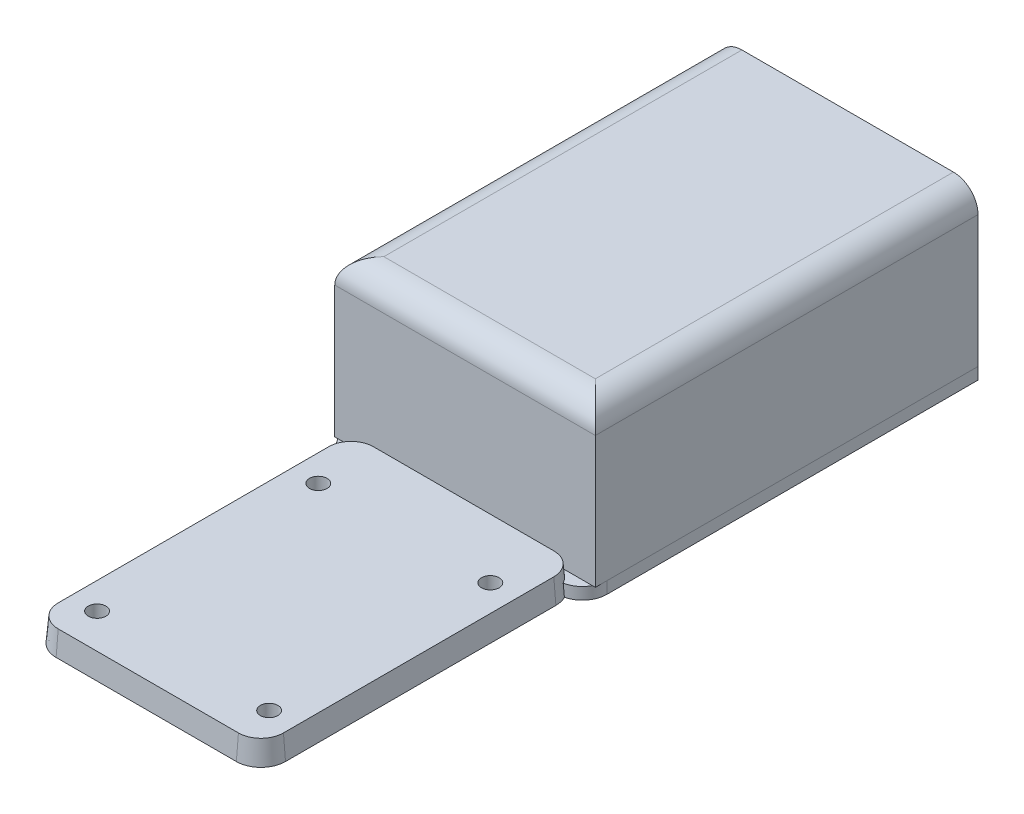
from build123d import *

# Parameters (mm, degrees)
BOSS_EXTRUDE1_DEPTH        = 5.8
BOSS_EXTRUDE1_TAPER        = 5
F_4_3_4_3_DIAMETER_HOLE1_D = 4.3
BOSS_EXTRUDE2_DEPTH        = 2.9
F_4_3_4_3_DIAMETER_HOLE2_D = 4.3
SKETCH18_W                 = 63.624338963
SKETCH18_H                 = 93.403718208
BOSS_EXTRUDE4_DEPTH        = 38.1
SKETCH19_W                 = 58.42
SKETCH19_H                 = 25.4
CUT_EXTRUDE1_DEPTH         = 88.9
F_2_5MM_DOWEL_HOLE3_D      = 2.5
F_2_5MM_DOWEL_HOLE3_DEPTH  = 12.7
F_2_5MM_DOWEL_HOLE3_TIP    = 0.751075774
FILLET1_R                  = 5.9944


with BuildPart() as part:
    # Sketch1 → Boss-Extrude1 (new body)
    with BuildSketch(Plane(origin=(0, 0, 0), x_dir=(1, 0, 0), z_dir=(0, 1, 0))):
        with BuildLine():
            ThreePointArc((22, -39), (26.242640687, -37.242640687), (28, -33))
            Line((28, -33), (28, 33))
            ThreePointArc((28, 33), (26.242640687, 37.242640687), (22, 39))
            Line((22, 39), (-22, 39))
            ThreePointArc((-22, 39), (-26.242640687, 37.242640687), (-28, 33))
            Line((-28, 33), (-28, -33))
            ThreePointArc((-28, -33), (-26.242640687, -37.242640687), (-22, -39))
            Line((-22, -39), (22, -39))
        make_face()
    extrude(amount=BOSS_EXTRUDE1_DEPTH, taper=BOSS_EXTRUDE1_TAPER)

    # 4.3 _4.3_ Diameter Hole1 (through all)
    with Locations(Plane(origin=(0, 5.8, 0), x_dir=(1, 0, 0), z_dir=(0, 1, 0))):
        with Locations((-21, 24), (21, -30), (21, 24), (-21, -30)):
            Hole(F_4_3_4_3_DIAMETER_HOLE1_D / 2)

    # Sketch6 → Boss-Extrude2 (add)
    with BuildSketch(Plane(origin=(0, 0, 0), x_dir=(-1, 0, 0), z_dir=(0, -1, 0))):
        with BuildLine():
            Line((31.674740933, 41.587574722), (31.674740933, 132.155434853))
            Line((31.674740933, 132.155434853), (-31.887770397, 132.155434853))
            Line((-31.887770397, 132.155434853), (-31.887770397, 41.587574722))
            ThreePointArc((-31.887770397, 41.587574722), (-30.130411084, 37.344934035), (-25.887770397, 35.587574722))
            Line((-25.887770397, 35.587574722), (25.674740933, 35.587574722))
            ThreePointArc((25.674740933, 35.587574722), (29.91738162, 37.344934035), (31.674740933, 41.587574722))
        make_face()
    extrude(amount=-BOSS_EXTRUDE2_DEPTH)

    # 4.3 _4.3_ Diameter Hole2 (through all)
    with Locations(Plane(origin=(-21, 5.8, -24), x_dir=(0, 0, 1), z_dir=(0, 1, 0))):
        with Locations((0, 0), (0, 42), (54, 42), (54, 0)):
            Hole(F_4_3_4_3_DIAMETER_HOLE2_D / 2)

    # Sketch18 → Boss-Extrude4 (add)
    with BuildSketch(Plane(origin=(0, 2.9, 0), x_dir=(1, 0, 0), z_dir=(0, 1, 0))):
        with Locations((0.083434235, 85.44814198)):
            Rectangle(SKETCH18_W, SKETCH18_H)
    extrude(amount=BOSS_EXTRUDE4_DEPTH)

    # Sketch19 → Cut-Extrude1 (cut)
    with BuildSketch(Plane(origin=(0, 0, -132.150001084), x_dir=(-1, 0, 0), z_dir=(0, 0, -1))):
        with Locations((-0.191487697, 21.196446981)):
            Rectangle(SKETCH19_W, SKETCH19_H)
    extrude(amount=-CUT_EXTRUDE1_DEPTH, mode=Mode.SUBTRACT)

    # 2.5mm Dowel Hole3
    with Locations(Plane(origin=(0, 0, -132.150001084), x_dir=(-1, 0, 0), z_dir=(0, 0, -1))):
        with Locations((0, 37.314487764), (0, 5.040881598)):
            Hole(F_2_5MM_DOWEL_HOLE3_D / 2, depth=F_2_5MM_DOWEL_HOLE3_DEPTH)
            with Locations((0, 0, -(F_2_5MM_DOWEL_HOLE3_DEPTH + F_2_5MM_DOWEL_HOLE3_TIP / 2))):  # 118° drill point
                Cone(0, F_2_5MM_DOWEL_HOLE3_D / 2, F_2_5MM_DOWEL_HOLE3_TIP, mode=Mode.SUBTRACT)

    # Fillet1
    fillet1_edges = [part.edges().sort_by_distance(p)[0] for p in [
        (31.895603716, 41, -85.44814198),
        (-31.728735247, 41, -85.44814198),
        (0.083434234, 41, -38.746282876),
    ]]
    fillet(fillet1_edges, radius=FILLET1_R)


solid = part.part
